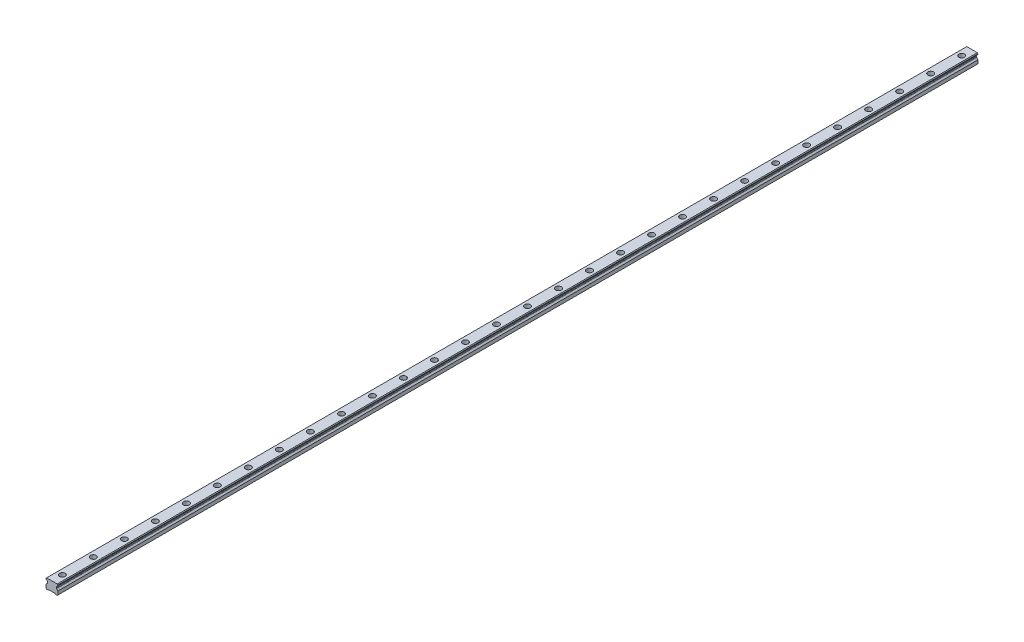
from build123d import *

# Parameters (mm, degrees)
SKETCH1_W           = 23
SKETCH1_H           = 19.2
BOSS_EXTRUDE1_DEPTH = 890
CUT_EXTRUDE1_DEPTH  = 1781.140693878
CHAMFER1_SIZE       = 1.25
FILLET1_R           = 1.25
CUT_EXTRUDE2_DEPTH  = 1781.140693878
SKETCH4_R           = 5.5
SKETCH4_R_2         = 3.5
CUT_EXTRUDE3_DEPTH  = 9
SKETCH4_2_R         = 3.5
CUT_EXTRUDE4_DEPTH  = 891.281354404
LPATTERN1_COUNT     = 30
LPATTERN1_PITCH     = 60


with BuildPart() as part:
    # Sketch1 → Boss-Extrude1 (new, symmetric)
    with BuildSketch(Plane.XY):
        with Locations((0, 9.6)):
            Rectangle(SKETCH1_W, SKETCH1_H)
    extrude(amount=BOSS_EXTRUDE1_DEPTH, both=True)

    # Sketch2 → Cut-Extrude1 (cut, through all)
    with BuildSketch(Plane.XY.offset(890)):
        Polygon((-11.5, 16.7), (-11.5, 7.95), (-8.583333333, 10.866666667), (-8.583333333, 13.783333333), align=None)
        Polygon((8.583333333, 13.783333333), (11.5, 16.7), (11.5, 7.95), (8.583333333, 10.866666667), align=None)
    extrude(amount=-CUT_EXTRUDE1_DEPTH, mode=Mode.SUBTRACT)

    # Chamfer1
    chamfer1_edges = [part.edges().sort_by_distance(p)[0] for p in [
        (-11.5, 19.2, 0),
        (11.5, 19.2, 0),
        (11.5, 0, 0),
        (-11.5, 0, 0),
    ]]
    chamfer(chamfer1_edges, length=CHAMFER1_SIZE)

    # Fillet1
    fillet1_edges = [part.edges().sort_by_distance(p)[0] for p in [
        (-8.583333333, 13.783333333, 0),
        (-8.583333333, 10.866666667, 0),
        (8.583333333, 10.866666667, 0),
        (8.583333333, 13.783333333, 0),
    ]]
    fillet(fillet1_edges, radius=FILLET1_R)

    # Sketch3 → Cut-Extrude2 (cut, through all)
    with BuildSketch(Plane.XY.offset(890)):
        Polygon((-7, 0), (-5.75, 1.25), (5.75, 1.25), (7, 0), align=None)
    extrude(amount=-CUT_EXTRUDE2_DEPTH, mode=Mode.SUBTRACT)

    # Sketch4 → Cut-Extrude3 (cut)
    with BuildSketch(Plane(origin=(0, 19.2, 0), x_dir=(1, 0, 0), z_dir=(0, 1, 0))):
        with Locations(Location((0, -870, 0), (0, 0, 270))):
            Circle(SKETCH4_R)
        with Locations(Location((0, -870, 0), (0, 0, 270))):
            Circle(SKETCH4_R_2, mode=Mode.SUBTRACT)
    cut_extrude3 = extrude(amount=-CUT_EXTRUDE3_DEPTH, mode=Mode.SUBTRACT)

    # Sketch4_2 → Cut-Extrude4 (cut, through all)
    with BuildSketch(Plane(origin=(0, 19.2, 0), x_dir=(1, 0, 0), z_dir=(0, 1, 0))):
        with Locations(Location((0, -870, 0), (0, 0, 270))):
            Circle(SKETCH4_2_R)
    cut_extrude4 = extrude(amount=-CUT_EXTRUDE4_DEPTH, mode=Mode.SUBTRACT)

    # LPattern1: Cut-Extrude3, Cut-Extrude4 ×30
    with Locations(*[(0, 0, -i * LPATTERN1_PITCH) for i in range(1, LPATTERN1_COUNT)]):
        add(cut_extrude3, mode=Mode.SUBTRACT)
        add(cut_extrude4, mode=Mode.SUBTRACT)


solid = part.part
